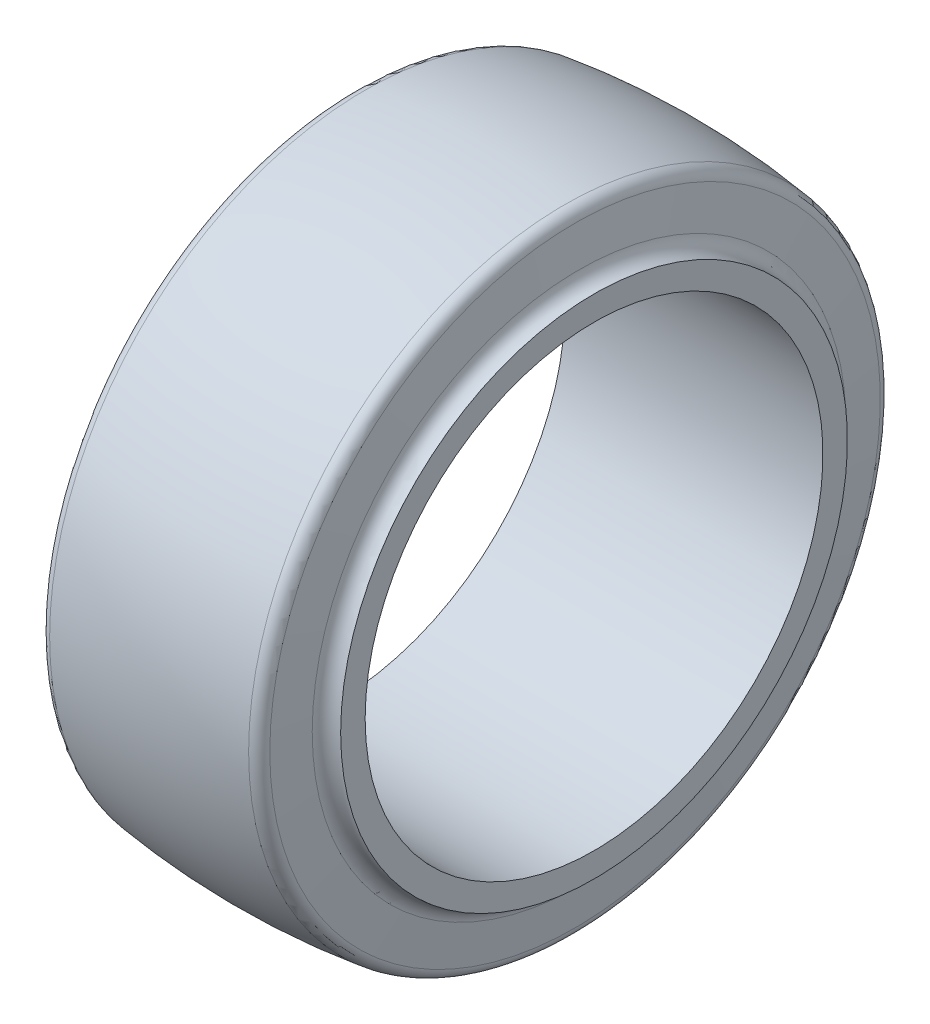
ISO-10303-21;
HEADER;
FILE_DESCRIPTION(('STEP AP214'),'2;1');
FILE_NAME('part.step','',(''),(''),'','','');
FILE_SCHEMA(('AUTOMOTIVE_DESIGN { 1 0 10303 214 1 1 1 1 }'));
ENDSEC;
DATA;
#1=APPLICATION_CONTEXT('core data for automotive mechanical design processes');
#2=APPLICATION_PROTOCOL_DEFINITION('international standard','automotive_design',2000,#1);
#3=PRODUCT_CONTEXT('',#1,'mechanical');
#4=PRODUCT('Part','Part','',(#3));
#5=PRODUCT_RELATED_PRODUCT_CATEGORY('part','',(#4));
#6=PRODUCT_DEFINITION_FORMATION('','',#4);
#7=PRODUCT_DEFINITION_CONTEXT('part definition',#1,'design');
#8=PRODUCT_DEFINITION('design','',#6,#7);
#9=PRODUCT_DEFINITION_SHAPE('','',#8);
#10=(LENGTH_UNIT() NAMED_UNIT(*) SI_UNIT(.MILLI.,.METRE.));
#11=(NAMED_UNIT(*) PLANE_ANGLE_UNIT() SI_UNIT($,.RADIAN.));
#12=(NAMED_UNIT(*) SI_UNIT($,.STERADIAN.) SOLID_ANGLE_UNIT());
#13=UNCERTAINTY_MEASURE_WITH_UNIT(LENGTH_MEASURE(1.E-05),#10,'distance_accuracy_value','');
#14=(GEOMETRIC_REPRESENTATION_CONTEXT(3) GLOBAL_UNCERTAINTY_ASSIGNED_CONTEXT((#13)) GLOBAL_UNIT_ASSIGNED_CONTEXT((#10,
#11,#12)) REPRESENTATION_CONTEXT('',''));
#15=CARTESIAN_POINT('',(0.,0.,0.));
#16=DIRECTION('',(0.,0.,1.));
#17=DIRECTION('',(1.,0.,0.));
#18=AXIS2_PLACEMENT_3D('',#15,#16,#17);
#19=CARTESIAN_POINT('',(-33.1636538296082,0.,0.));
#20=DIRECTION('',(-1.,0.,0.));
#21=DIRECTION('',(0.,0.,1.));
#22=AXIS2_PLACEMENT_3D('',#19,#20,#21);
#23=CYLINDRICAL_SURFACE('',#22,45.085);
#24=CARTESIAN_POINT('',(-25.4,0.,0.));
#25=DIRECTION('',(-1.,0.,0.));
#26=DIRECTION('',(0.,0.,1.));
#27=AXIS2_PLACEMENT_3D('',#24,#25,#26);
#28=CIRCLE('',#27,45.085);
#29=CARTESIAN_POINT('',(-25.4,0.,45.085));
#30=VERTEX_POINT('',#29);
#31=EDGE_CURVE('E128',#30,#30,#28,.T.);
#32=ORIENTED_EDGE('',*,*,#31,.T.);
#33=EDGE_LOOP('',(#32));
#34=FACE_BOUND('',#33,.T.);
#35=CARTESIAN_POINT('',(25.4,0.,0.));
#36=DIRECTION('',(-1.,0.,0.));
#37=DIRECTION('',(0.,0.,1.));
#38=AXIS2_PLACEMENT_3D('',#35,#36,#37);
#39=CIRCLE('',#38,45.085);
#40=CARTESIAN_POINT('',(25.4,0.,45.085));
#41=VERTEX_POINT('',#40);
#42=EDGE_CURVE('E18',#41,#41,#39,.F.);
#43=ORIENTED_EDGE('',*,*,#42,.T.);
#44=EDGE_LOOP('',(#43));
#45=FACE_BOUND('',#44,.T.);
#46=ADVANCED_FACE('F14',(#34,#45),#23,.F.);
#47=CARTESIAN_POINT('',(25.4,45.085,0.));
#48=DIRECTION('',(-1.,0.,0.));
#49=DIRECTION('',(0.,0.,1.));
#50=AXIS2_PLACEMENT_3D('',#47,#48,#49);
#51=PLANE('',#50);
#52=ORIENTED_EDGE('',*,*,#42,.F.);
#53=EDGE_LOOP('',(#52));
#54=FACE_BOUND('',#53,.T.);
#55=CARTESIAN_POINT('',(25.4,0.,0.));
#56=DIRECTION('',(-1.,0.,0.));
#57=DIRECTION('',(0.,0.,1.));
#58=AXIS2_PLACEMENT_3D('',#55,#56,#57);
#59=CIRCLE('',#58,49.911);
#60=CARTESIAN_POINT('',(25.4,0.,49.911));
#61=VERTEX_POINT('',#60);
#62=EDGE_CURVE('E126',#61,#61,#59,.F.);
#63=ORIENTED_EDGE('',*,*,#62,.T.);
#64=EDGE_LOOP('',(#63));
#65=FACE_BOUND('',#64,.T.);
#66=ADVANCED_FACE('F90',(#54,#65),#51,.F.);
#67=CARTESIAN_POINT('',(-25.4,45.085,0.));
#68=DIRECTION('',(1.,0.,0.));
#69=DIRECTION('',(0.,0.,-1.));
#70=AXIS2_PLACEMENT_3D('',#67,#68,#69);
#71=PLANE('',#70);
#72=ORIENTED_EDGE('',*,*,#31,.F.);
#73=EDGE_LOOP('',(#72));
#74=FACE_BOUND('',#73,.T.);
#75=CARTESIAN_POINT('',(-25.4,0.,0.));
#76=DIRECTION('',(-1.,0.,0.));
#77=DIRECTION('',(0.,0.,1.));
#78=AXIS2_PLACEMENT_3D('',#75,#76,#77);
#79=CIRCLE('',#78,49.911);
#80=CARTESIAN_POINT('',(-25.4,0.,49.911));
#81=VERTEX_POINT('',#80);
#82=EDGE_CURVE('E70',#81,#81,#79,.T.);
#83=ORIENTED_EDGE('',*,*,#82,.T.);
#84=EDGE_LOOP('',(#83));
#85=FACE_BOUND('',#84,.T.);
#86=ADVANCED_FACE('F86',(#74,#85),#71,.F.);
#87=CARTESIAN_POINT('',(25.4,0.,0.));
#88=DIRECTION('',(-1.,0.,0.));
#89=DIRECTION('',(0.,0.,1.));
#90=AXIS2_PLACEMENT_3D('',#87,#88,#89);
#91=TOROIDAL_SURFACE('',#90,52.8745403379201,2.96354033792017);
#92=ORIENTED_EDGE('',*,*,#62,.F.);
#93=EDGE_LOOP('',(#92));
#94=FACE_BOUND('',#93,.T.);
#95=CARTESIAN_POINT('',(22.4526942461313,0.,0.));
#96=DIRECTION('',(-1.,0.,0.));
#97=DIRECTION('',(0.,0.,1.));
#98=AXIS2_PLACEMENT_3D('',#95,#96,#97);
#99=CIRCLE('',#98,52.5647660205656);
#100=CARTESIAN_POINT('',(22.4526942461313,0.,52.5647660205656));
#101=VERTEX_POINT('',#100);
#102=EDGE_CURVE('E64',#101,#101,#99,.T.);
#103=ORIENTED_EDGE('',*,*,#102,.F.);
#104=EDGE_LOOP('',(#103));
#105=FACE_BOUND('',#104,.T.);
#106=ADVANCED_FACE('F82',(#94,#105),#91,.F.);
#107=CARTESIAN_POINT('',(-25.4,0.,0.));
#108=DIRECTION('',(-1.,0.,0.));
#109=DIRECTION('',(0.,0.,1.));
#110=AXIS2_PLACEMENT_3D('',#107,#108,#109);
#111=TOROIDAL_SURFACE('',#110,52.8745403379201,2.96354033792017);
#112=CARTESIAN_POINT('',(-22.4526942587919,0.,0.));
#113=DIRECTION('',(1.,0.,0.));
#114=DIRECTION('',(0.,0.,-1.));
#115=AXIS2_PLACEMENT_3D('',#112,#113,#114);
#116=CIRCLE('',#115,52.5647660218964);
#117=CARTESIAN_POINT('',(-22.4526942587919,0.,-52.5647660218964));
#118=VERTEX_POINT('',#117);
#119=EDGE_CURVE('E59',#118,#118,#116,.T.);
#120=ORIENTED_EDGE('',*,*,#119,.F.);
#121=EDGE_LOOP('',(#120));
#122=FACE_BOUND('',#121,.T.);
#123=ORIENTED_EDGE('',*,*,#82,.F.);
#124=EDGE_LOOP('',(#123));
#125=FACE_BOUND('',#124,.T.);
#126=ADVANCED_FACE('F78',(#122,#125),#111,.F.);
#127=CARTESIAN_POINT('',(21.6583679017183,0.,0.));
#128=DIRECTION('',(-1.,0.,0.));
#129=DIRECTION('',(0.,0.,1.));
#130=AXIS2_PLACEMENT_3D('',#127,#128,#129);
#131=CONICAL_SURFACE('',#130,60.1222762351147,1.46607657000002);
#132=CARTESIAN_POINT('',(21.6583679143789,0.,0.));
#133=DIRECTION('',(-1.,0.,0.));
#134=DIRECTION('',(0.,0.,1.));
#135=AXIS2_PLACEMENT_3D('',#132,#133,#134);
#136=CIRCLE('',#135,60.1222762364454);
#137=CARTESIAN_POINT('',(21.6583679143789,0.,60.1222762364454));
#138=VERTEX_POINT('',#137);
#139=EDGE_CURVE('E56',#138,#138,#136,.T.);
#140=ORIENTED_EDGE('',*,*,#139,.F.);
#141=EDGE_LOOP('',(#140));
#142=FACE_BOUND('',#141,.T.);
#143=ORIENTED_EDGE('',*,*,#102,.T.);
#144=EDGE_LOOP('',(#143));
#145=FACE_BOUND('',#144,.T.);
#146=ADVANCED_FACE('F81',(#142,#145),#131,.T.);
#147=CARTESIAN_POINT('',(-21.6583679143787,0.,0.));
#148=DIRECTION('',(1.,0.,0.));
#149=DIRECTION('',(0.,0.,-1.));
#150=AXIS2_PLACEMENT_3D('',#147,#148,#149);
#151=CONICAL_SURFACE('',#150,60.1222762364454,1.46607657);
#152=CARTESIAN_POINT('',(-21.6583679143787,0.,0.));
#153=DIRECTION('',(-1.,0.,0.));
#154=DIRECTION('',(0.,0.,1.));
#155=AXIS2_PLACEMENT_3D('',#152,#153,#154);
#156=CIRCLE('',#155,60.1222762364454);
#157=CARTESIAN_POINT('',(-21.6583679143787,0.,60.1222762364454));
#158=VERTEX_POINT('',#157);
#159=EDGE_CURVE('E31',#158,#158,#156,.F.);
#160=ORIENTED_EDGE('',*,*,#159,.F.);
#161=EDGE_LOOP('',(#160));
#162=FACE_BOUND('',#161,.T.);
#163=ORIENTED_EDGE('',*,*,#119,.T.);
#164=EDGE_LOOP('',(#163));
#165=FACE_BOUND('',#164,.T.);
#166=ADVANCED_FACE('F50',(#162,#165),#151,.T.);
#167=CARTESIAN_POINT('',(19.2901626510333,0.,0.));
#168=DIRECTION('',(-1.,0.,0.));
#169=DIRECTION('',(0.,0.,1.));
#170=AXIS2_PLACEMENT_3D('',#167,#168,#169);
#171=TOROIDAL_SURFACE('',#170,59.8733678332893,2.38124999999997);
#172=CARTESIAN_POINT('',(19.5963557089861,0.,0.));
#173=DIRECTION('',(-1.,0.,0.));
#174=DIRECTION('',(0.,0.,1.));
#175=AXIS2_PLACEMENT_3D('',#172,#173,#174);
#176=CIRCLE('',#175,62.234849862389);
#177=CARTESIAN_POINT('',(19.5963557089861,0.,62.2348498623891));
#178=VERTEX_POINT('',#177);
#179=EDGE_CURVE('E23',#178,#178,#176,.T.);
#180=ORIENTED_EDGE('',*,*,#179,.F.);
#181=EDGE_LOOP('',(#180));
#182=FACE_BOUND('',#181,.T.);
#183=ORIENTED_EDGE('',*,*,#139,.T.);
#184=EDGE_LOOP('',(#183));
#185=FACE_BOUND('',#184,.T.);
#186=ADVANCED_FACE('F45',(#182,#185),#171,.T.);
#187=CARTESIAN_POINT('',(-19.290162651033,0.,0.));
#188=DIRECTION('',(-1.,0.,0.));
#189=DIRECTION('',(0.,0.,1.));
#190=AXIS2_PLACEMENT_3D('',#187,#188,#189);
#191=TOROIDAL_SURFACE('',#190,59.8733678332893,2.38125);
#192=ORIENTED_EDGE('',*,*,#159,.T.);
#193=EDGE_LOOP('',(#192));
#194=FACE_BOUND('',#193,.T.);
#195=CARTESIAN_POINT('',(-19.5963557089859,0.,0.));
#196=DIRECTION('',(1.,0.,0.));
#197=DIRECTION('',(0.,0.,-1.));
#198=AXIS2_PLACEMENT_3D('',#195,#196,#197);
#199=CIRCLE('',#198,62.234849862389);
#200=CARTESIAN_POINT('',(-19.5963557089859,0.,-62.234849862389));
#201=VERTEX_POINT('',#200);
#202=EDGE_CURVE('E10',#201,#201,#199,.T.);
#203=ORIENTED_EDGE('',*,*,#202,.F.);
#204=EDGE_LOOP('',(#203));
#205=FACE_BOUND('',#204,.T.);
#206=ADVANCED_FACE('F42',(#194,#205),#191,.T.);
#207=CARTESIAN_POINT('',(0.,0.,0.));
#208=DIRECTION('',(1.,0.,0.));
#209=DIRECTION('',(0.,0.,-1.));
#210=AXIS2_PLACEMENT_3D('',#207,#208,#209);
#211=DEGENERATE_TOROIDAL_SURFACE('',#210,88.9000000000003,152.4,.F.);
#212=ORIENTED_EDGE('',*,*,#202,.T.);
#213=EDGE_LOOP('',(#212));
#214=FACE_BOUND('',#213,.T.);
#215=ORIENTED_EDGE('',*,*,#179,.T.);
#216=EDGE_LOOP('',(#215));
#217=FACE_BOUND('',#216,.T.);
#218=ADVANCED_FACE('F16',(#214,#217),#211,.F.);
#219=CLOSED_SHELL('',(#46,#66,#86,#106,#126,#146,#166,#186,#206,#218));
#220=MANIFOLD_SOLID_BREP('B1',#219);
#221=ADVANCED_BREP_SHAPE_REPRESENTATION('',(#18,#220),#14);
#222=SHAPE_DEFINITION_REPRESENTATION(#9,#221);
ENDSEC;
END-ISO-10303-21;
